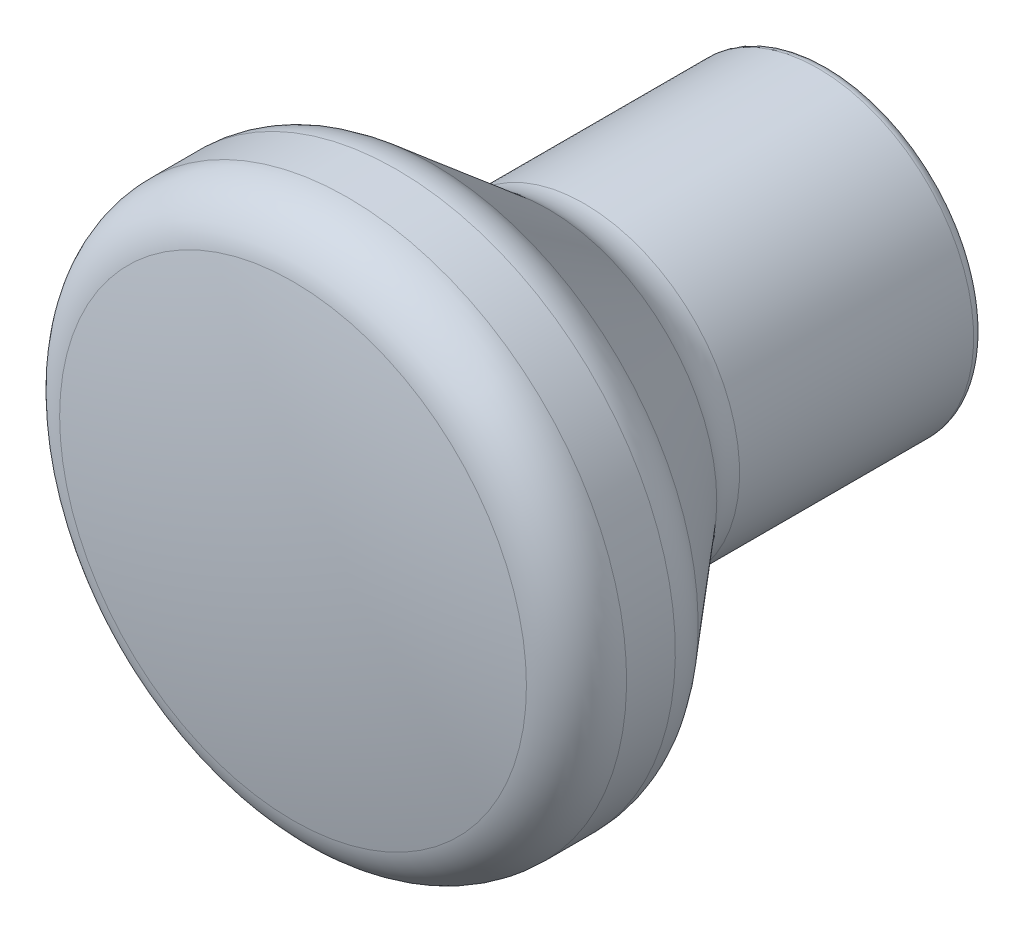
ISO-10303-21;
HEADER;
FILE_DESCRIPTION(('STEP AP214'),'2;1');
FILE_NAME('part.step','',(''),(''),'','','');
FILE_SCHEMA(('AUTOMOTIVE_DESIGN { 1 0 10303 214 1 1 1 1 }'));
ENDSEC;
DATA;
#1=APPLICATION_CONTEXT('core data for automotive mechanical design processes');
#2=APPLICATION_PROTOCOL_DEFINITION('international standard','automotive_design',2000,#1);
#3=PRODUCT_CONTEXT('',#1,'mechanical');
#4=PRODUCT('Part','Part','',(#3));
#5=PRODUCT_RELATED_PRODUCT_CATEGORY('part','',(#4));
#6=PRODUCT_DEFINITION_FORMATION('','',#4);
#7=PRODUCT_DEFINITION_CONTEXT('part definition',#1,'design');
#8=PRODUCT_DEFINITION('design','',#6,#7);
#9=PRODUCT_DEFINITION_SHAPE('','',#8);
#10=(LENGTH_UNIT() NAMED_UNIT(*) SI_UNIT(.MILLI.,.METRE.));
#11=(NAMED_UNIT(*) PLANE_ANGLE_UNIT() SI_UNIT($,.RADIAN.));
#12=(NAMED_UNIT(*) SI_UNIT($,.STERADIAN.) SOLID_ANGLE_UNIT());
#13=UNCERTAINTY_MEASURE_WITH_UNIT(LENGTH_MEASURE(1.E-05),#10,'distance_accuracy_value','');
#14=(GEOMETRIC_REPRESENTATION_CONTEXT(3) GLOBAL_UNCERTAINTY_ASSIGNED_CONTEXT((#13)) GLOBAL_UNIT_ASSIGNED_CONTEXT((#10,
#11,#12)) REPRESENTATION_CONTEXT('',''));
#15=CARTESIAN_POINT('',(0.,0.,0.));
#16=DIRECTION('',(0.,0.,1.));
#17=DIRECTION('',(1.,0.,0.));
#18=AXIS2_PLACEMENT_3D('',#15,#16,#17);
#19=CARTESIAN_POINT('',(0.,0.,-49.9999999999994));
#20=DIRECTION('',(0.,0.,-1.));
#21=DIRECTION('',(1.,0.,0.));
#22=AXIS2_PLACEMENT_3D('',#19,#20,#21);
#23=SPHERICAL_SURFACE('',#22,90.);
#24=CARTESIAN_POINT('',(0.,0.,38.4286844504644));
#25=DIRECTION('',(0.,0.,-1.));
#26=DIRECTION('',(0.,1.,0.));
#27=AXIS2_PLACEMENT_3D('',#24,#25,#26);
#28=CIRCLE('',#27,16.7441860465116);
#29=CARTESIAN_POINT('',(0.,16.7441860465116,38.4286844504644));
#30=VERTEX_POINT('',#29);
#31=EDGE_CURVE('E8',#30,#30,#28,.T.);
#32=ORIENTED_EDGE('',*,*,#31,.F.);
#33=EDGE_LOOP('',(#32));
#34=FACE_BOUND('',#33,.T.);
#35=ADVANCED_FACE('F12',(#34),#23,.T.);
#36=CARTESIAN_POINT('',(0.,0.,34.4985206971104));
#37=DIRECTION('',(0.,0.,-1.));
#38=DIRECTION('',(0.,1.,0.));
#39=AXIS2_PLACEMENT_3D('',#36,#37,#38);
#40=TOROIDAL_SURFACE('',#39,16.,4.);
#41=ORIENTED_EDGE('',*,*,#31,.T.);
#42=EDGE_LOOP('',(#41));
#43=FACE_BOUND('',#42,.T.);
#44=CARTESIAN_POINT('',(0.,0.,34.4985206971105));
#45=DIRECTION('',(0.,0.,-1.));
#46=DIRECTION('',(0.,1.,0.));
#47=AXIS2_PLACEMENT_3D('',#44,#45,#46);
#48=CIRCLE('',#47,20.);
#49=CARTESIAN_POINT('',(0.,20.,34.4985206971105));
#50=VERTEX_POINT('',#49);
#51=EDGE_CURVE('E18',#50,#50,#48,.T.);
#52=ORIENTED_EDGE('',*,*,#51,.F.);
#53=EDGE_LOOP('',(#52));
#54=FACE_BOUND('',#53,.T.);
#55=ADVANCED_FACE('F77',(#43,#54),#40,.T.);
#56=CARTESIAN_POINT('',(0.,0.,0.));
#57=DIRECTION('',(0.,0.,-1.));
#58=DIRECTION('',(0.,1.,0.));
#59=AXIS2_PLACEMENT_3D('',#56,#57,#58);
#60=CYLINDRICAL_SURFACE('',#59,20.);
#61=CARTESIAN_POINT('',(0.,0.,31.0029002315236));
#62=DIRECTION('',(0.,0.,-1.));
#63=DIRECTION('',(0.,1.,0.));
#64=AXIS2_PLACEMENT_3D('',#61,#62,#63);
#65=CIRCLE('',#64,20.);
#66=CARTESIAN_POINT('',(0.,20.,31.0029002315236));
#67=VERTEX_POINT('',#66);
#68=EDGE_CURVE('E22',#67,#67,#65,.T.);
#69=ORIENTED_EDGE('',*,*,#68,.F.);
#70=EDGE_LOOP('',(#69));
#71=FACE_BOUND('',#70,.T.);
#72=ORIENTED_EDGE('',*,*,#51,.T.);
#73=EDGE_LOOP('',(#72));
#74=FACE_BOUND('',#73,.T.);
#75=ADVANCED_FACE('F82',(#71,#74),#60,.T.);
#76=CARTESIAN_POINT('',(0.,0.,31.0029002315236));
#77=DIRECTION('',(0.,0.,-1.));
#78=DIRECTION('',(0.,1.,0.));
#79=AXIS2_PLACEMENT_3D('',#76,#77,#78);
#80=TOROIDAL_SURFACE('',#79,16.,4.);
#81=ORIENTED_EDGE('',*,*,#68,.T.);
#82=EDGE_LOOP('',(#81));
#83=FACE_BOUND('',#82,.T.);
#84=CARTESIAN_POINT('',(0.,0.,28.4317497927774));
#85=DIRECTION('',(0.,0.,-1.));
#86=DIRECTION('',(0.,1.,0.));
#87=AXIS2_PLACEMENT_3D('',#84,#85,#86);
#88=CIRCLE('',#87,19.0641777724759);
#89=CARTESIAN_POINT('',(0.,19.0641777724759,28.4317497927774));
#90=VERTEX_POINT('',#89);
#91=EDGE_CURVE('E26',#90,#90,#88,.T.);
#92=ORIENTED_EDGE('',*,*,#91,.F.);
#93=EDGE_LOOP('',(#92));
#94=FACE_BOUND('',#93,.T.);
#95=ADVANCED_FACE('F86',(#83,#94),#80,.T.);
#96=CARTESIAN_POINT('',(0.,0.,28.4317497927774));
#97=DIRECTION('',(0.,0.,1.));
#98=DIRECTION('',(0.,-1.,0.));
#99=AXIS2_PLACEMENT_3D('',#96,#97,#98);
#100=CONICAL_SURFACE('',#99,19.0641777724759,0.698131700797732);
#101=CARTESIAN_POINT('',(0.,0.,20.1152695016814));
#102=DIRECTION('',(0.,0.,-1.));
#103=DIRECTION('',(0.,1.,0.));
#104=AXIS2_PLACEMENT_3D('',#101,#102,#103);
#105=CIRCLE('',#104,12.0858222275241);
#106=CARTESIAN_POINT('',(0.,12.0858222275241,20.1152695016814));
#107=VERTEX_POINT('',#106);
#108=EDGE_CURVE('E31',#107,#107,#105,.T.);
#109=ORIENTED_EDGE('',*,*,#108,.F.);
#110=EDGE_LOOP('',(#109));
#111=FACE_BOUND('',#110,.T.);
#112=ORIENTED_EDGE('',*,*,#91,.T.);
#113=EDGE_LOOP('',(#112));
#114=FACE_BOUND('',#113,.T.);
#115=ADVANCED_FACE('F93',(#111,#114),#100,.T.);
#116=CARTESIAN_POINT('',(0.,0.,17.5441190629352));
#117=DIRECTION('',(0.,0.,-1.));
#118=DIRECTION('',(0.,1.,0.));
#119=AXIS2_PLACEMENT_3D('',#116,#117,#118);
#120=TOROIDAL_SURFACE('',#119,15.15,4.);
#121=CARTESIAN_POINT('',(0.,0.,17.5441190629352));
#122=DIRECTION('',(0.,0.,-1.));
#123=DIRECTION('',(0.,1.,0.));
#124=AXIS2_PLACEMENT_3D('',#121,#122,#123);
#125=CIRCLE('',#124,11.15);
#126=CARTESIAN_POINT('',(0.,11.15,17.5441190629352));
#127=VERTEX_POINT('',#126);
#128=EDGE_CURVE('E34',#127,#127,#125,.T.);
#129=ORIENTED_EDGE('',*,*,#128,.F.);
#130=EDGE_LOOP('',(#129));
#131=FACE_BOUND('',#130,.T.);
#132=ORIENTED_EDGE('',*,*,#108,.T.);
#133=EDGE_LOOP('',(#132));
#134=FACE_BOUND('',#133,.T.);
#135=ADVANCED_FACE('F73',(#131,#134),#120,.F.);
#136=CARTESIAN_POINT('',(0.,0.,0.));
#137=DIRECTION('',(0.,0.,-1.));
#138=DIRECTION('',(0.,1.,0.));
#139=AXIS2_PLACEMENT_3D('',#136,#137,#138);
#140=CYLINDRICAL_SURFACE('',#139,11.15);
#141=CARTESIAN_POINT('',(0.,0.,0.75));
#142=DIRECTION('',(0.,0.,-1.));
#143=DIRECTION('',(0.,1.,0.));
#144=AXIS2_PLACEMENT_3D('',#141,#142,#143);
#145=CIRCLE('',#144,11.15);
#146=CARTESIAN_POINT('',(0.,11.15,0.75));
#147=VERTEX_POINT('',#146);
#148=EDGE_CURVE('E37',#147,#147,#145,.T.);
#149=ORIENTED_EDGE('',*,*,#148,.F.);
#150=EDGE_LOOP('',(#149));
#151=FACE_BOUND('',#150,.T.);
#152=ORIENTED_EDGE('',*,*,#128,.T.);
#153=EDGE_LOOP('',(#152));
#154=FACE_BOUND('',#153,.T.);
#155=ADVANCED_FACE('F66',(#151,#154),#140,.T.);
#156=CARTESIAN_POINT('',(0.,0.,0.75));
#157=DIRECTION('',(0.,0.,-1.));
#158=DIRECTION('',(0.,1.,0.));
#159=AXIS2_PLACEMENT_3D('',#156,#157,#158);
#160=TOROIDAL_SURFACE('',#159,10.4,0.75);
#161=ORIENTED_EDGE('',*,*,#148,.T.);
#162=EDGE_LOOP('',(#161));
#163=FACE_BOUND('',#162,.T.);
#164=CARTESIAN_POINT('',(0.,0.,0.));
#165=DIRECTION('',(0.,0.,-1.));
#166=DIRECTION('',(0.,1.,0.));
#167=AXIS2_PLACEMENT_3D('',#164,#165,#166);
#168=CIRCLE('',#167,10.4);
#169=CARTESIAN_POINT('',(0.,10.4,0.));
#170=VERTEX_POINT('',#169);
#171=EDGE_CURVE('E40',#170,#170,#168,.T.);
#172=ORIENTED_EDGE('',*,*,#171,.F.);
#173=EDGE_LOOP('',(#172));
#174=FACE_BOUND('',#173,.T.);
#175=ADVANCED_FACE('F61',(#163,#174),#160,.T.);
#176=CARTESIAN_POINT('',(10.4,0.,0.));
#177=DIRECTION('',(0.,0.,1.));
#178=DIRECTION('',(0.,-1.,0.));
#179=AXIS2_PLACEMENT_3D('',#176,#177,#178);
#180=PLANE('',#179);
#181=CARTESIAN_POINT('',(0.,0.,0.));
#182=DIRECTION('',(0.,0.,-1.));
#183=DIRECTION('',(0.,1.,0.));
#184=AXIS2_PLACEMENT_3D('',#181,#182,#183);
#185=CIRCLE('',#184,5.);
#186=CARTESIAN_POINT('',(0.,5.,0.));
#187=VERTEX_POINT('',#186);
#188=EDGE_CURVE('E44',#187,#187,#185,.T.);
#189=ORIENTED_EDGE('',*,*,#188,.F.);
#190=EDGE_LOOP('',(#189));
#191=FACE_BOUND('',#190,.T.);
#192=ORIENTED_EDGE('',*,*,#171,.T.);
#193=EDGE_LOOP('',(#192));
#194=FACE_BOUND('',#193,.T.);
#195=ADVANCED_FACE('F55',(#191,#194),#180,.F.);
#196=CARTESIAN_POINT('',(0.,0.,20.));
#197=DIRECTION('',(0.,0.,-1.));
#198=DIRECTION('',(0.,1.,0.));
#199=AXIS2_PLACEMENT_3D('',#196,#197,#198);
#200=CYLINDRICAL_SURFACE('',#199,5.);
#201=CARTESIAN_POINT('',(0.,0.,20.));
#202=DIRECTION('',(0.,0.,-1.));
#203=DIRECTION('',(0.,1.,0.));
#204=AXIS2_PLACEMENT_3D('',#201,#202,#203);
#205=CIRCLE('',#204,5.);
#206=CARTESIAN_POINT('',(0.,5.,20.));
#207=VERTEX_POINT('',#206);
#208=EDGE_CURVE('E43',#207,#207,#205,.T.);
#209=ORIENTED_EDGE('',*,*,#208,.F.);
#210=EDGE_LOOP('',(#209));
#211=FACE_BOUND('',#210,.T.);
#212=ORIENTED_EDGE('',*,*,#188,.T.);
#213=EDGE_LOOP('',(#212));
#214=FACE_BOUND('',#213,.T.);
#215=ADVANCED_FACE('F52',(#211,#214),#200,.F.);
#216=CARTESIAN_POINT('',(0.,0.,20.));
#217=DIRECTION('',(0.,0.,-1.));
#218=DIRECTION('',(0.,1.,0.));
#219=AXIS2_PLACEMENT_3D('',#216,#217,#218);
#220=PLANE('',#219);
#221=ORIENTED_EDGE('',*,*,#208,.T.);
#222=EDGE_LOOP('',(#221));
#223=FACE_BOUND('',#222,.T.);
#224=ADVANCED_FACE('F50',(#223),#220,.T.);
#225=CLOSED_SHELL('',(#35,#55,#75,#95,#115,#135,#155,#175,#195,#215,#224));
#226=MANIFOLD_SOLID_BREP('B1',#225);
#227=ADVANCED_BREP_SHAPE_REPRESENTATION('',(#18,#226),#14);
#228=SHAPE_DEFINITION_REPRESENTATION(#9,#227);
ENDSEC;
END-ISO-10303-21;
